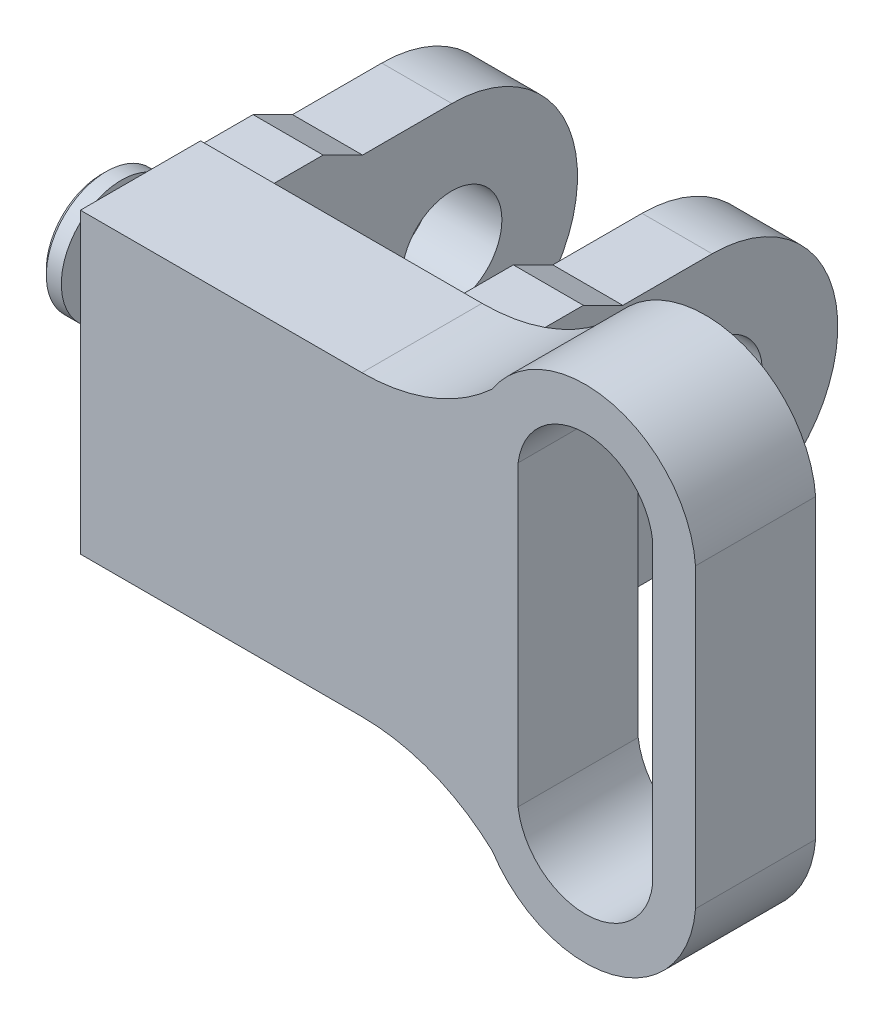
ISO-10303-21;
HEADER;
FILE_DESCRIPTION(('STEP AP214'),'2;1');
FILE_NAME('part.step','',(''),(''),'','','');
FILE_SCHEMA(('AUTOMOTIVE_DESIGN { 1 0 10303 214 1 1 1 1 }'));
ENDSEC;
DATA;
#1=APPLICATION_CONTEXT('core data for automotive mechanical design processes');
#2=APPLICATION_PROTOCOL_DEFINITION('international standard','automotive_design',2000,#1);
#3=PRODUCT_CONTEXT('',#1,'mechanical');
#4=PRODUCT('Part','Part','',(#3));
#5=PRODUCT_RELATED_PRODUCT_CATEGORY('part','',(#4));
#6=PRODUCT_DEFINITION_FORMATION('','',#4);
#7=PRODUCT_DEFINITION_CONTEXT('part definition',#1,'design');
#8=PRODUCT_DEFINITION('design','',#6,#7);
#9=PRODUCT_DEFINITION_SHAPE('','',#8);
#10=(LENGTH_UNIT() NAMED_UNIT(*) SI_UNIT(.MILLI.,.METRE.));
#11=(NAMED_UNIT(*) PLANE_ANGLE_UNIT() SI_UNIT($,.RADIAN.));
#12=(NAMED_UNIT(*) SI_UNIT($,.STERADIAN.) SOLID_ANGLE_UNIT());
#13=UNCERTAINTY_MEASURE_WITH_UNIT(LENGTH_MEASURE(1.E-05),#10,'distance_accuracy_value','');
#14=(GEOMETRIC_REPRESENTATION_CONTEXT(3) GLOBAL_UNCERTAINTY_ASSIGNED_CONTEXT((#13)) GLOBAL_UNIT_ASSIGNED_CONTEXT((#10,
#11,#12)) REPRESENTATION_CONTEXT('',''));
#15=CARTESIAN_POINT('',(0.,0.,0.));
#16=DIRECTION('',(0.,0.,1.));
#17=DIRECTION('',(1.,0.,0.));
#18=AXIS2_PLACEMENT_3D('',#15,#16,#17);
#19=CARTESIAN_POINT('',(237.915887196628,113.664011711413,-12.));
#20=DIRECTION('',(-1.,0.,0.));
#21=DIRECTION('',(0.,0.,-1.));
#22=AXIS2_PLACEMENT_3D('',#19,#20,#21);
#23=PLANE('',#22);
#24=DIRECTION('',(0.,-1.,0.));
#25=VECTOR('',#24,1.);
#26=CARTESIAN_POINT('',(237.915887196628,113.664011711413,-12.));
#27=LINE('',#26,#25);
#28=CARTESIAN_POINT('',(237.915887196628,143.421521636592,-12.));
#29=VERTEX_POINT('',#28);
#30=CARTESIAN_POINT('',(237.915887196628,113.664011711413,-12.));
#31=VERTEX_POINT('',#30);
#32=EDGE_CURVE('E383',#29,#31,#27,.T.);
#33=ORIENTED_EDGE('',*,*,#32,.F.);
#34=DIRECTION('',(0.,0.,-1.));
#35=VECTOR('',#34,1.);
#36=CARTESIAN_POINT('',(237.915887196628,143.421521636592,-12.));
#37=LINE('',#36,#35);
#38=CARTESIAN_POINT('',(237.915887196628,143.421521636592,-24.));
#39=VERTEX_POINT('',#38);
#40=EDGE_CURVE('E398',#29,#39,#37,.T.);
#41=ORIENTED_EDGE('',*,*,#40,.T.);
#42=DIRECTION('',(0.,-1.,0.));
#43=VECTOR('',#42,1.);
#44=CARTESIAN_POINT('',(237.915887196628,113.664011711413,-24.));
#45=LINE('',#44,#43);
#46=CARTESIAN_POINT('',(237.915887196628,143.068699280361,-24.));
#47=VERTEX_POINT('',#46);
#48=EDGE_CURVE('E366',#39,#47,#45,.T.);
#49=ORIENTED_EDGE('',*,*,#48,.T.);
#50=DIRECTION('',(0.,0.,1.));
#51=VECTOR('',#50,1.);
#52=CARTESIAN_POINT('',(237.915887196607,143.068699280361,-11.9999999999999));
#53=LINE('',#52,#51);
#54=CARTESIAN_POINT('',(237.915887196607,143.068699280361,-29.2445517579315));
#55=VERTEX_POINT('',#54);
#56=EDGE_CURVE('E288',#55,#47,#53,.T.);
#57=ORIENTED_EDGE('',*,*,#56,.F.);
#58=DIRECTION('',(0.,0.44721359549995,0.89442719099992));
#59=VECTOR('',#58,1.);
#60=CARTESIAN_POINT('',(237.915887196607,143.068699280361,-29.2445517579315));
#61=LINE('',#60,#59);
#62=CARTESIAN_POINT('',(237.915887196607,141.09831503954,-33.1853202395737));
#63=VERTEX_POINT('',#62);
#64=EDGE_CURVE('E274',#63,#55,#61,.T.);
#65=ORIENTED_EDGE('',*,*,#64,.F.);
#66=DIRECTION('',(0.,0.,1.));
#67=VECTOR('',#66,1.);
#68=CARTESIAN_POINT('',(237.915887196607,141.09831503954,-33.1853202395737));
#69=LINE('',#68,#67);
#70=CARTESIAN_POINT('',(237.915887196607,141.09831503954,-42.1039015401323));
#71=VERTEX_POINT('',#70);
#72=EDGE_CURVE('E303',#71,#63,#69,.T.);
#73=ORIENTED_EDGE('',*,*,#72,.F.);
#74=CARTESIAN_POINT('',(237.915887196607,128.542766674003,-42.1039015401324));
#75=DIRECTION('',(1.,0.,0.));
#76=DIRECTION('',(0.,0.,1.));
#77=AXIS2_PLACEMENT_3D('',#74,#75,#76);
#78=CIRCLE('',#77,12.5555483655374);
#79=CARTESIAN_POINT('',(237.915887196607,115.987218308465,-42.1039015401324));
#80=VERTEX_POINT('',#79);
#81=EDGE_CURVE('E300',#80,#71,#78,.T.);
#82=ORIENTED_EDGE('',*,*,#81,.F.);
#83=DIRECTION('',(0.,0.,-1.));
#84=VECTOR('',#83,1.);
#85=CARTESIAN_POINT('',(237.915887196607,115.987218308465,-33.1853202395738));
#86=LINE('',#85,#84);
#87=CARTESIAN_POINT('',(237.915887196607,115.987218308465,-33.1853202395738));
#88=VERTEX_POINT('',#87);
#89=EDGE_CURVE('E297',#88,#80,#86,.T.);
#90=ORIENTED_EDGE('',*,*,#89,.F.);
#91=DIRECTION('',(0.,0.447213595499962,-0.894427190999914));
#92=VECTOR('',#91,1.);
#93=CARTESIAN_POINT('',(237.915887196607,114.016834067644,-29.2445517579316));
#94=LINE('',#93,#92);
#95=CARTESIAN_POINT('',(237.915887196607,114.016834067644,-29.2445517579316));
#96=VERTEX_POINT('',#95);
#97=EDGE_CURVE('E294',#96,#88,#94,.T.);
#98=ORIENTED_EDGE('',*,*,#97,.F.);
#99=DIRECTION('',(0.,0.,-1.));
#100=VECTOR('',#99,1.);
#101=CARTESIAN_POINT('',(237.915887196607,114.016834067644,-12.));
#102=LINE('',#101,#100);
#103=CARTESIAN_POINT('',(237.915887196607,114.016834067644,-24.));
#104=VERTEX_POINT('',#103);
#105=EDGE_CURVE('E291',#104,#96,#102,.T.);
#106=ORIENTED_EDGE('',*,*,#105,.F.);
#107=CARTESIAN_POINT('',(237.915887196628,113.664011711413,-24.));
#108=VERTEX_POINT('',#107);
#109=EDGE_CURVE('E365',#104,#108,#45,.T.);
#110=ORIENTED_EDGE('',*,*,#109,.T.);
#111=DIRECTION('',(0.,0.,-1.));
#112=VECTOR('',#111,1.);
#113=CARTESIAN_POINT('',(237.915887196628,113.664011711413,-12.));
#114=LINE('',#113,#112);
#115=EDGE_CURVE('E418',#31,#108,#114,.T.);
#116=ORIENTED_EDGE('',*,*,#115,.F.);
#117=EDGE_LOOP('',(#33,#41,#49,#57,#65,#73,#82,#90,#98,#106,#110,#116));
#118=FACE_BOUND('',#117,.T.);
#119=CARTESIAN_POINT('',(237.915887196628,128.542766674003,-42.1039015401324));
#120=DIRECTION('',(1.,0.,0.));
#121=DIRECTION('',(0.,0.,-1.));
#122=AXIS2_PLACEMENT_3D('',#119,#120,#121);
#123=CIRCLE('',#122,5.);
#124=CARTESIAN_POINT('',(237.915887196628,128.542766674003,-47.1039015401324));
#125=VERTEX_POINT('',#124);
#126=EDGE_CURVE('E442',#125,#125,#123,.T.);
#127=ORIENTED_EDGE('',*,*,#126,.T.);
#128=EDGE_LOOP('',(#127));
#129=FACE_BOUND('',#128,.T.);
#130=CARTESIAN_POINT('',(237.915887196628,133.981521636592,-20.09));
#131=DIRECTION('',(1.,0.,0.));
#132=DIRECTION('',(0.,0.,-1.));
#133=AXIS2_PLACEMENT_3D('',#130,#131,#132);
#134=CIRCLE('',#133,6.);
#135=CARTESIAN_POINT('',(237.915887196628,133.981521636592,-26.09));
#136=VERTEX_POINT('',#135);
#137=EDGE_CURVE('E881',#136,#136,#134,.T.);
#138=ORIENTED_EDGE('',*,*,#137,.T.);
#139=EDGE_LOOP('',(#138));
#140=FACE_BOUND('',#139,.T.);
#141=ADVANCED_FACE('F36',(#118,#129,#140),#23,.T.);
#142=CARTESIAN_POINT('',(237.915887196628,143.421521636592,-12.));
#143=DIRECTION('',(0.,1.,0.));
#144=DIRECTION('',(0.,0.,-1.));
#145=AXIS2_PLACEMENT_3D('',#142,#143,#144);
#146=PLANE('',#145);
#147=DIRECTION('',(-1.,0.,0.));
#148=VECTOR('',#147,1.);
#149=CARTESIAN_POINT('',(237.915887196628,143.421521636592,-24.));
#150=LINE('',#149,#148);
#151=CARTESIAN_POINT('',(266.034275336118,143.421521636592,-24.));
#152=VERTEX_POINT('',#151);
#153=EDGE_CURVE('E363',#152,#39,#150,.T.);
#154=ORIENTED_EDGE('',*,*,#153,.T.);
#155=ORIENTED_EDGE('',*,*,#40,.F.);
#156=DIRECTION('',(-1.,0.,0.));
#157=VECTOR('',#156,1.);
#158=CARTESIAN_POINT('',(237.915887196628,143.421521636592,-12.));
#159=LINE('',#158,#157);
#160=CARTESIAN_POINT('',(266.034275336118,143.421521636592,-12.));
#161=VERTEX_POINT('',#160);
#162=EDGE_CURVE('E381',#161,#29,#159,.T.);
#163=ORIENTED_EDGE('',*,*,#162,.F.);
#164=DIRECTION('',(0.,0.,-1.));
#165=VECTOR('',#164,1.);
#166=CARTESIAN_POINT('',(266.034275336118,143.421521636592,-12.));
#167=LINE('',#166,#165);
#168=EDGE_CURVE('E399',#161,#152,#167,.T.);
#169=ORIENTED_EDGE('',*,*,#168,.T.);
#170=EDGE_LOOP('',(#154,#155,#163,#169));
#171=FACE_BOUND('',#170,.T.);
#172=ADVANCED_FACE('F38',(#171),#146,.T.);
#173=CARTESIAN_POINT('',(266.034275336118,162.613016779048,-12.));
#174=DIRECTION('',(0.,0.,-1.));
#175=DIRECTION('',(1.,0.,0.));
#176=AXIS2_PLACEMENT_3D('',#173,#174,#175);
#177=CYLINDRICAL_SURFACE('',#176,19.1914951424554);
#178=CARTESIAN_POINT('',(266.034275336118,162.613016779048,-24.));
#179=DIRECTION('',(0.,0.,-1.));
#180=DIRECTION('',(1.,0.,0.));
#181=AXIS2_PLACEMENT_3D('',#178,#179,#180);
#182=CIRCLE('',#181,19.1914951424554);
#183=CARTESIAN_POINT('',(279.064164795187,148.522755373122,-24.));
#184=VERTEX_POINT('',#183);
#185=EDGE_CURVE('E379',#184,#152,#182,.T.);
#186=ORIENTED_EDGE('',*,*,#185,.T.);
#187=ORIENTED_EDGE('',*,*,#168,.F.);
#188=CARTESIAN_POINT('',(266.034275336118,162.613016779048,-12.));
#189=DIRECTION('',(0.,0.,-1.));
#190=DIRECTION('',(1.,0.,0.));
#191=AXIS2_PLACEMENT_3D('',#188,#189,#190);
#192=CIRCLE('',#191,19.1914951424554);
#193=CARTESIAN_POINT('',(279.064164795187,148.522755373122,-12.));
#194=VERTEX_POINT('',#193);
#195=EDGE_CURVE('E396',#194,#161,#192,.T.);
#196=ORIENTED_EDGE('',*,*,#195,.F.);
#197=DIRECTION('',(0.,0.,-1.));
#198=VECTOR('',#197,1.);
#199=CARTESIAN_POINT('',(279.064164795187,148.522755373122,-12.));
#200=LINE('',#199,#198);
#201=EDGE_CURVE('E403',#194,#184,#200,.T.);
#202=ORIENTED_EDGE('',*,*,#201,.T.);
#203=EDGE_LOOP('',(#186,#187,#196,#202));
#204=FACE_BOUND('',#203,.T.);
#205=ADVANCED_FACE('F473',(#204),#177,.F.);
#206=CARTESIAN_POINT('',(288.343991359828,142.520870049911,-12.));
#207=DIRECTION('',(0.,0.,-1.));
#208=DIRECTION('',(1.,0.,0.));
#209=AXIS2_PLACEMENT_3D('',#206,#207,#208);
#210=CYLINDRICAL_SURFACE('',#209,11.0515975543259);
#211=CARTESIAN_POINT('',(288.343991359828,142.520870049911,-24.));
#212=DIRECTION('',(0.,0.,1.));
#213=DIRECTION('',(-1.,0.,0.));
#214=AXIS2_PLACEMENT_3D('',#211,#212,#213);
#215=CIRCLE('',#214,11.0515975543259);
#216=CARTESIAN_POINT('',(299.362616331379,143.373930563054,-24.));
#217=VERTEX_POINT('',#216);
#218=EDGE_CURVE('E377',#217,#184,#215,.T.);
#219=ORIENTED_EDGE('',*,*,#218,.T.);
#220=ORIENTED_EDGE('',*,*,#201,.F.);
#221=CARTESIAN_POINT('',(288.343991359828,142.520870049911,-12.));
#222=DIRECTION('',(0.,0.,1.));
#223=DIRECTION('',(-1.,0.,0.));
#224=AXIS2_PLACEMENT_3D('',#221,#222,#223);
#225=CIRCLE('',#224,11.0515975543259);
#226=CARTESIAN_POINT('',(299.362616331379,143.373930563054,-12.));
#227=VERTEX_POINT('',#226);
#228=EDGE_CURVE('E394',#227,#194,#225,.T.);
#229=ORIENTED_EDGE('',*,*,#228,.F.);
#230=DIRECTION('',(0.,0.,-1.));
#231=VECTOR('',#230,1.);
#232=CARTESIAN_POINT('',(299.362616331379,143.373930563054,-12.));
#233=LINE('',#232,#231);
#234=EDGE_CURVE('E406',#227,#217,#233,.T.);
#235=ORIENTED_EDGE('',*,*,#234,.T.);
#236=EDGE_LOOP('',(#219,#220,#229,#235));
#237=FACE_BOUND('',#236,.T.);
#238=ADVANCED_FACE('F494',(#237),#210,.T.);
#239=CARTESIAN_POINT('',(299.362616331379,143.373930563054,-12.));
#240=DIRECTION('',(1.,0.,0.));
#241=DIRECTION('',(0.,0.,1.));
#242=AXIS2_PLACEMENT_3D('',#239,#240,#241);
#243=PLANE('',#242);
#244=DIRECTION('',(0.,1.,0.));
#245=VECTOR('',#244,1.);
#246=CARTESIAN_POINT('',(299.362616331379,143.373930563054,-24.));
#247=LINE('',#246,#245);
#248=CARTESIAN_POINT('',(299.362616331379,113.711602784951,-24.));
#249=VERTEX_POINT('',#248);
#250=EDGE_CURVE('E375',#249,#217,#247,.T.);
#251=ORIENTED_EDGE('',*,*,#250,.T.);
#252=ORIENTED_EDGE('',*,*,#234,.F.);
#253=DIRECTION('',(0.,1.,0.));
#254=VECTOR('',#253,1.);
#255=CARTESIAN_POINT('',(299.362616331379,143.373930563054,-12.));
#256=LINE('',#255,#254);
#257=CARTESIAN_POINT('',(299.362616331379,113.711602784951,-12.));
#258=VERTEX_POINT('',#257);
#259=EDGE_CURVE('E392',#258,#227,#256,.T.);
#260=ORIENTED_EDGE('',*,*,#259,.F.);
#261=DIRECTION('',(0.,0.,-1.));
#262=VECTOR('',#261,1.);
#263=CARTESIAN_POINT('',(299.362616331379,113.711602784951,-12.));
#264=LINE('',#263,#262);
#265=EDGE_CURVE('E409',#258,#249,#264,.T.);
#266=ORIENTED_EDGE('',*,*,#265,.T.);
#267=EDGE_LOOP('',(#251,#252,#260,#266));
#268=FACE_BOUND('',#267,.T.);
#269=ADVANCED_FACE('F490',(#268),#243,.T.);
#270=CARTESIAN_POINT('',(288.343991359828,114.564663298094,-12.));
#271=DIRECTION('',(0.,0.,-1.));
#272=DIRECTION('',(1.,0.,0.));
#273=AXIS2_PLACEMENT_3D('',#270,#271,#272);
#274=CYLINDRICAL_SURFACE('',#273,11.0515975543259);
#275=CARTESIAN_POINT('',(288.343991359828,114.564663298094,-24.));
#276=DIRECTION('',(0.,0.,1.));
#277=DIRECTION('',(1.,0.,0.));
#278=AXIS2_PLACEMENT_3D('',#275,#276,#277);
#279=CIRCLE('',#278,11.0515975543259);
#280=CARTESIAN_POINT('',(279.064164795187,108.562777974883,-24.));
#281=VERTEX_POINT('',#280);
#282=EDGE_CURVE('E373',#281,#249,#279,.T.);
#283=ORIENTED_EDGE('',*,*,#282,.T.);
#284=ORIENTED_EDGE('',*,*,#265,.F.);
#285=CARTESIAN_POINT('',(288.343991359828,114.564663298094,-12.));
#286=DIRECTION('',(0.,0.,1.));
#287=DIRECTION('',(1.,0.,0.));
#288=AXIS2_PLACEMENT_3D('',#285,#286,#287);
#289=CIRCLE('',#288,11.0515975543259);
#290=CARTESIAN_POINT('',(279.064164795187,108.562777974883,-12.));
#291=VERTEX_POINT('',#290);
#292=EDGE_CURVE('E390',#291,#258,#289,.T.);
#293=ORIENTED_EDGE('',*,*,#292,.F.);
#294=DIRECTION('',(0.,0.,-1.));
#295=VECTOR('',#294,1.);
#296=CARTESIAN_POINT('',(279.064164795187,108.562777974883,-12.));
#297=LINE('',#296,#295);
#298=EDGE_CURVE('E412',#291,#281,#297,.T.);
#299=ORIENTED_EDGE('',*,*,#298,.T.);
#300=EDGE_LOOP('',(#283,#284,#293,#299));
#301=FACE_BOUND('',#300,.T.);
#302=ADVANCED_FACE('F486',(#301),#274,.T.);
#303=CARTESIAN_POINT('',(266.034275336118,94.4725165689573,-12.));
#304=DIRECTION('',(0.,0.,-1.));
#305=DIRECTION('',(1.,0.,0.));
#306=AXIS2_PLACEMENT_3D('',#303,#304,#305);
#307=CYLINDRICAL_SURFACE('',#306,19.1914951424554);
#308=CARTESIAN_POINT('',(266.034275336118,94.4725165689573,-24.));
#309=DIRECTION('',(0.,0.,-1.));
#310=DIRECTION('',(-1.,0.,0.));
#311=AXIS2_PLACEMENT_3D('',#308,#309,#310);
#312=CIRCLE('',#311,19.1914951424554);
#313=CARTESIAN_POINT('',(266.034275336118,113.664011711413,-24.));
#314=VERTEX_POINT('',#313);
#315=EDGE_CURVE('E371',#314,#281,#312,.T.);
#316=ORIENTED_EDGE('',*,*,#315,.T.);
#317=ORIENTED_EDGE('',*,*,#298,.F.);
#318=CARTESIAN_POINT('',(266.034275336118,94.4725165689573,-12.));
#319=DIRECTION('',(0.,0.,-1.));
#320=DIRECTION('',(-1.,0.,0.));
#321=AXIS2_PLACEMENT_3D('',#318,#319,#320);
#322=CIRCLE('',#321,19.1914951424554);
#323=CARTESIAN_POINT('',(266.034275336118,113.664011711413,-12.));
#324=VERTEX_POINT('',#323);
#325=EDGE_CURVE('E388',#324,#291,#322,.T.);
#326=ORIENTED_EDGE('',*,*,#325,.F.);
#327=DIRECTION('',(0.,0.,-1.));
#328=VECTOR('',#327,1.);
#329=CARTESIAN_POINT('',(266.034275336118,113.664011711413,-12.));
#330=LINE('',#329,#328);
#331=EDGE_CURVE('E415',#324,#314,#330,.T.);
#332=ORIENTED_EDGE('',*,*,#331,.T.);
#333=EDGE_LOOP('',(#316,#317,#326,#332));
#334=FACE_BOUND('',#333,.T.);
#335=ADVANCED_FACE('F482',(#334),#307,.F.);
#336=CARTESIAN_POINT('',(237.915887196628,113.664011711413,-12.));
#337=DIRECTION('',(0.,-1.,0.));
#338=DIRECTION('',(0.,0.,1.));
#339=AXIS2_PLACEMENT_3D('',#336,#337,#338);
#340=PLANE('',#339);
#341=DIRECTION('',(1.,0.,0.));
#342=VECTOR('',#341,1.);
#343=CARTESIAN_POINT('',(237.915887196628,113.664011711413,-24.));
#344=LINE('',#343,#342);
#345=EDGE_CURVE('E369',#108,#314,#344,.T.);
#346=ORIENTED_EDGE('',*,*,#345,.T.);
#347=ORIENTED_EDGE('',*,*,#331,.F.);
#348=DIRECTION('',(1.,0.,0.));
#349=VECTOR('',#348,1.);
#350=CARTESIAN_POINT('',(237.915887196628,113.664011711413,-12.));
#351=LINE('',#350,#349);
#352=EDGE_CURVE('E386',#31,#324,#351,.T.);
#353=ORIENTED_EDGE('',*,*,#352,.F.);
#354=ORIENTED_EDGE('',*,*,#115,.T.);
#355=EDGE_LOOP('',(#346,#347,#353,#354));
#356=FACE_BOUND('',#355,.T.);
#357=ADVANCED_FACE('F478',(#356),#340,.T.);
#358=CARTESIAN_POINT('',(266.034275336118,162.613016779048,-12.));
#359=DIRECTION('',(0.,0.,-1.));
#360=DIRECTION('',(1.,0.,0.));
#361=AXIS2_PLACEMENT_3D('',#358,#359,#360);
#362=PLANE('',#361);
#363=ORIENTED_EDGE('',*,*,#352,.T.);
#364=ORIENTED_EDGE('',*,*,#325,.T.);
#365=ORIENTED_EDGE('',*,*,#292,.T.);
#366=ORIENTED_EDGE('',*,*,#259,.T.);
#367=ORIENTED_EDGE('',*,*,#228,.T.);
#368=ORIENTED_EDGE('',*,*,#195,.T.);
#369=ORIENTED_EDGE('',*,*,#162,.T.);
#370=ORIENTED_EDGE('',*,*,#32,.T.);
#371=EDGE_LOOP('',(#363,#364,#365,#366,#367,#368,#369,#370));
#372=FACE_BOUND('',#371,.T.);
#373=DIRECTION('',(0.,1.,0.));
#374=VECTOR('',#373,1.);
#375=CARTESIAN_POINT('',(295.08459489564,162.613016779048,-12.));
#376=LINE('',#375,#374);
#377=CARTESIAN_POINT('',(295.08459489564,113.711602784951,-12.));
#378=VERTEX_POINT('',#377);
#379=CARTESIAN_POINT('',(295.08459489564,143.373930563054,-12.));
#380=VERTEX_POINT('',#379);
#381=EDGE_CURVE('E357',#378,#380,#376,.T.);
#382=ORIENTED_EDGE('',*,*,#381,.F.);
#383=CARTESIAN_POINT('',(288.357820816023,114.510142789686,-12.));
#384=DIRECTION('',(0.,0.,1.));
#385=DIRECTION('',(1.,0.,0.));
#386=AXIS2_PLACEMENT_3D('',#383,#384,#385);
#387=CIRCLE('',#386,6.77400587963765);
#388=CARTESIAN_POINT('',(281.636867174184,113.664011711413,-12.));
#389=VERTEX_POINT('',#388);
#390=EDGE_CURVE('E354',#389,#378,#387,.T.);
#391=ORIENTED_EDGE('',*,*,#390,.F.);
#392=DIRECTION('',(0.,-1.,0.));
#393=VECTOR('',#392,1.);
#394=CARTESIAN_POINT('',(281.636867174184,162.613016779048,-12.));
#395=LINE('',#394,#393);
#396=CARTESIAN_POINT('',(281.636867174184,143.421521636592,-12.));
#397=VERTEX_POINT('',#396);
#398=EDGE_CURVE('E346',#397,#389,#395,.T.);
#399=ORIENTED_EDGE('',*,*,#398,.F.);
#400=CARTESIAN_POINT('',(288.357820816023,142.575390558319,-12.));
#401=DIRECTION('',(0.,0.,1.));
#402=DIRECTION('',(1.,0.,0.));
#403=AXIS2_PLACEMENT_3D('',#400,#401,#402);
#404=CIRCLE('',#403,6.77400587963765);
#405=EDGE_CURVE('E360',#380,#397,#404,.T.);
#406=ORIENTED_EDGE('',*,*,#405,.F.);
#407=EDGE_LOOP('',(#382,#391,#399,#406));
#408=FACE_BOUND('',#407,.T.);
#409=ADVANCED_FACE('F481',(#372,#408),#362,.F.);
#410=CARTESIAN_POINT('',(266.034275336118,162.613016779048,-24.));
#411=DIRECTION('',(0.,0.,-1.));
#412=DIRECTION('',(1.,0.,0.));
#413=AXIS2_PLACEMENT_3D('',#410,#411,#412);
#414=PLANE('',#413);
#415=DIRECTION('',(0.,1.,0.));
#416=VECTOR('',#415,1.);
#417=CARTESIAN_POINT('',(270.915887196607,162.613016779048,-24.));
#418=LINE('',#417,#416);
#419=CARTESIAN_POINT('',(270.915887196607,114.016834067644,-24.));
#420=VERTEX_POINT('',#419);
#421=CARTESIAN_POINT('',(270.915887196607,143.068699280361,-24.));
#422=VERTEX_POINT('',#421);
#423=EDGE_CURVE('E436',#420,#422,#418,.T.);
#424=ORIENTED_EDGE('',*,*,#423,.T.);
#425=DIRECTION('',(-1.,0.,0.));
#426=VECTOR('',#425,1.);
#427=CARTESIAN_POINT('',(266.034275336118,143.068699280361,-24.));
#428=LINE('',#427,#426);
#429=CARTESIAN_POINT('',(263.915887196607,143.068699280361,-24.));
#430=VERTEX_POINT('',#429);
#431=EDGE_CURVE('E431',#422,#430,#428,.T.);
#432=ORIENTED_EDGE('',*,*,#431,.T.);
#433=DIRECTION('',(0.,1.,0.));
#434=VECTOR('',#433,1.);
#435=CARTESIAN_POINT('',(263.915887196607,162.613016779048,-24.));
#436=LINE('',#435,#434);
#437=CARTESIAN_POINT('',(263.915887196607,114.016834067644,-24.));
#438=VERTEX_POINT('',#437);
#439=EDGE_CURVE('E227',#438,#430,#436,.T.);
#440=ORIENTED_EDGE('',*,*,#439,.F.);
#441=DIRECTION('',(1.,0.,0.));
#442=VECTOR('',#441,1.);
#443=CARTESIAN_POINT('',(266.034275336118,114.016834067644,-24.));
#444=LINE('',#443,#442);
#445=EDGE_CURVE('E433',#438,#420,#444,.T.);
#446=ORIENTED_EDGE('',*,*,#445,.T.);
#447=EDGE_LOOP('',(#424,#432,#440,#446));
#448=FACE_BOUND('',#447,.T.);
#449=DIRECTION('',(1.,0.,0.));
#450=VECTOR('',#449,1.);
#451=CARTESIAN_POINT('',(266.034275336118,114.016834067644,-24.));
#452=LINE('',#451,#450);
#453=CARTESIAN_POINT('',(244.915887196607,114.016834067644,-24.));
#454=VERTEX_POINT('',#453);
#455=EDGE_CURVE('E427',#104,#454,#452,.T.);
#456=ORIENTED_EDGE('',*,*,#455,.T.);
#457=DIRECTION('',(0.,1.,0.));
#458=VECTOR('',#457,1.);
#459=CARTESIAN_POINT('',(244.915887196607,162.613016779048,-24.));
#460=LINE('',#459,#458);
#461=CARTESIAN_POINT('',(244.915887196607,143.068699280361,-24.));
#462=VERTEX_POINT('',#461);
#463=EDGE_CURVE('E402',#454,#462,#460,.T.);
#464=ORIENTED_EDGE('',*,*,#463,.T.);
#465=DIRECTION('',(-1.,0.,0.));
#466=VECTOR('',#465,1.);
#467=CARTESIAN_POINT('',(266.034275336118,143.068699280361,-24.));
#468=LINE('',#467,#466);
#469=EDGE_CURVE('E425',#462,#47,#468,.T.);
#470=ORIENTED_EDGE('',*,*,#469,.T.);
#471=ORIENTED_EDGE('',*,*,#48,.F.);
#472=ORIENTED_EDGE('',*,*,#153,.F.);
#473=ORIENTED_EDGE('',*,*,#185,.F.);
#474=ORIENTED_EDGE('',*,*,#218,.F.);
#475=ORIENTED_EDGE('',*,*,#250,.F.);
#476=ORIENTED_EDGE('',*,*,#282,.F.);
#477=ORIENTED_EDGE('',*,*,#315,.F.);
#478=ORIENTED_EDGE('',*,*,#345,.F.);
#479=ORIENTED_EDGE('',*,*,#109,.F.);
#480=EDGE_LOOP('',(#456,#464,#470,#471,#472,#473,#474,#475,#476,#477,#478,#479));
#481=FACE_BOUND('',#480,.T.);
#482=CARTESIAN_POINT('',(288.357820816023,142.575390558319,-24.));
#483=DIRECTION('',(0.,0.,1.));
#484=DIRECTION('',(1.,0.,0.));
#485=AXIS2_PLACEMENT_3D('',#482,#483,#484);
#486=CIRCLE('',#485,6.77400587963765);
#487=CARTESIAN_POINT('',(295.08459489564,143.373930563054,-24.));
#488=VERTEX_POINT('',#487);
#489=CARTESIAN_POINT('',(281.636867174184,143.421521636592,-24.));
#490=VERTEX_POINT('',#489);
#491=EDGE_CURVE('E322',#488,#490,#486,.T.);
#492=ORIENTED_EDGE('',*,*,#491,.T.);
#493=DIRECTION('',(0.,-1.,0.));
#494=VECTOR('',#493,1.);
#495=CARTESIAN_POINT('',(281.636867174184,143.421521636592,-24.));
#496=LINE('',#495,#494);
#497=CARTESIAN_POINT('',(281.636867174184,113.664011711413,-24.));
#498=VERTEX_POINT('',#497);
#499=EDGE_CURVE('E334',#490,#498,#496,.T.);
#500=ORIENTED_EDGE('',*,*,#499,.T.);
#501=CARTESIAN_POINT('',(288.357820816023,114.510142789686,-24.));
#502=DIRECTION('',(0.,0.,1.));
#503=DIRECTION('',(-1.,0.,0.));
#504=AXIS2_PLACEMENT_3D('',#501,#502,#503);
#505=CIRCLE('',#504,6.77400587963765);
#506=CARTESIAN_POINT('',(295.08459489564,113.711602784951,-24.));
#507=VERTEX_POINT('',#506);
#508=EDGE_CURVE('E337',#498,#507,#505,.T.);
#509=ORIENTED_EDGE('',*,*,#508,.T.);
#510=DIRECTION('',(0.,1.,0.));
#511=VECTOR('',#510,1.);
#512=CARTESIAN_POINT('',(295.08459489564,143.373930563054,-24.));
#513=LINE('',#512,#511);
#514=EDGE_CURVE('E340',#507,#488,#513,.T.);
#515=ORIENTED_EDGE('',*,*,#514,.T.);
#516=EDGE_LOOP('',(#492,#500,#509,#515));
#517=FACE_BOUND('',#516,.T.);
#518=ADVANCED_FACE('F504',(#448,#481,#517),#414,.T.);
#519=CARTESIAN_POINT('',(288.357820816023,142.575390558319,-4.));
#520=DIRECTION('',(0.,0.,-1.));
#521=DIRECTION('',(1.,0.,0.));
#522=AXIS2_PLACEMENT_3D('',#519,#520,#521);
#523=CYLINDRICAL_SURFACE('',#522,6.77400587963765);
#524=DIRECTION('',(0.,0.,-1.));
#525=VECTOR('',#524,1.);
#526=CARTESIAN_POINT('',(295.08459489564,143.373930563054,-4.));
#527=LINE('',#526,#525);
#528=EDGE_CURVE('E344',#380,#488,#527,.T.);
#529=ORIENTED_EDGE('',*,*,#528,.F.);
#530=ORIENTED_EDGE('',*,*,#405,.T.);
#531=DIRECTION('',(0.,0.,-1.));
#532=VECTOR('',#531,1.);
#533=CARTESIAN_POINT('',(281.636867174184,143.421521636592,-4.));
#534=LINE('',#533,#532);
#535=EDGE_CURVE('E343',#397,#490,#534,.T.);
#536=ORIENTED_EDGE('',*,*,#535,.T.);
#537=ORIENTED_EDGE('',*,*,#491,.F.);
#538=EDGE_LOOP('',(#529,#530,#536,#537));
#539=FACE_BOUND('',#538,.T.);
#540=ADVANCED_FACE('F508',(#539),#523,.F.);
#541=CARTESIAN_POINT('',(295.08459489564,143.373930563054,-4.));
#542=DIRECTION('',(1.,0.,0.));
#543=DIRECTION('',(0.,0.,1.));
#544=AXIS2_PLACEMENT_3D('',#541,#542,#543);
#545=PLANE('',#544);
#546=DIRECTION('',(0.,0.,-1.));
#547=VECTOR('',#546,1.);
#548=CARTESIAN_POINT('',(295.08459489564,113.711602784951,-4.));
#549=LINE('',#548,#547);
#550=EDGE_CURVE('E347',#378,#507,#549,.T.);
#551=ORIENTED_EDGE('',*,*,#550,.F.);
#552=ORIENTED_EDGE('',*,*,#381,.T.);
#553=ORIENTED_EDGE('',*,*,#528,.T.);
#554=ORIENTED_EDGE('',*,*,#514,.F.);
#555=EDGE_LOOP('',(#551,#552,#553,#554));
#556=FACE_BOUND('',#555,.T.);
#557=ADVANCED_FACE('F512',(#556),#545,.F.);
#558=CARTESIAN_POINT('',(288.357820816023,114.510142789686,-4.));
#559=DIRECTION('',(0.,0.,-1.));
#560=DIRECTION('',(1.,0.,0.));
#561=AXIS2_PLACEMENT_3D('',#558,#559,#560);
#562=CYLINDRICAL_SURFACE('',#561,6.77400587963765);
#563=DIRECTION('',(0.,0.,-1.));
#564=VECTOR('',#563,1.);
#565=CARTESIAN_POINT('',(281.636867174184,113.664011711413,-4.));
#566=LINE('',#565,#564);
#567=EDGE_CURVE('E349',#389,#498,#566,.T.);
#568=ORIENTED_EDGE('',*,*,#567,.F.);
#569=ORIENTED_EDGE('',*,*,#390,.T.);
#570=ORIENTED_EDGE('',*,*,#550,.T.);
#571=ORIENTED_EDGE('',*,*,#508,.F.);
#572=EDGE_LOOP('',(#568,#569,#570,#571));
#573=FACE_BOUND('',#572,.T.);
#574=ADVANCED_FACE('F518',(#573),#562,.F.);
#575=CARTESIAN_POINT('',(281.636867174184,143.421521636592,-4.));
#576=DIRECTION('',(-1.,0.,0.));
#577=DIRECTION('',(0.,0.,-1.));
#578=AXIS2_PLACEMENT_3D('',#575,#576,#577);
#579=PLANE('',#578);
#580=ORIENTED_EDGE('',*,*,#535,.F.);
#581=ORIENTED_EDGE('',*,*,#398,.T.);
#582=ORIENTED_EDGE('',*,*,#567,.T.);
#583=ORIENTED_EDGE('',*,*,#499,.F.);
#584=EDGE_LOOP('',(#580,#581,#582,#583));
#585=FACE_BOUND('',#584,.T.);
#586=ADVANCED_FACE('F514',(#585),#579,.F.);
#587=CARTESIAN_POINT('',(244.915887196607,143.068699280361,-29.2445517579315));
#588=DIRECTION('',(0.,0.89442719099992,-0.44721359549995));
#589=DIRECTION('',(0.,-0.44721359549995,-0.89442719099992));
#590=AXIS2_PLACEMENT_3D('',#587,#588,#589);
#591=PLANE('',#590);
#592=ORIENTED_EDGE('',*,*,#64,.T.);
#593=DIRECTION('',(-1.,0.,0.));
#594=VECTOR('',#593,1.);
#595=CARTESIAN_POINT('',(244.915887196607,143.068699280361,-29.2445517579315));
#596=LINE('',#595,#594);
#597=CARTESIAN_POINT('',(244.915887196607,143.068699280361,-29.2445517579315));
#598=VERTEX_POINT('',#597);
#599=EDGE_CURVE('E319',#598,#55,#596,.T.);
#600=ORIENTED_EDGE('',*,*,#599,.F.);
#601=DIRECTION('',(0.,0.44721359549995,0.89442719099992));
#602=VECTOR('',#601,1.);
#603=CARTESIAN_POINT('',(244.915887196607,143.068699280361,-29.2445517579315));
#604=LINE('',#603,#602);
#605=CARTESIAN_POINT('',(244.915887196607,141.09831503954,-33.1853202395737));
#606=VERTEX_POINT('',#605);
#607=EDGE_CURVE('E306',#606,#598,#604,.T.);
#608=ORIENTED_EDGE('',*,*,#607,.F.);
#609=DIRECTION('',(-1.,0.,0.));
#610=VECTOR('',#609,1.);
#611=CARTESIAN_POINT('',(244.915887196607,141.09831503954,-33.1853202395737));
#612=LINE('',#611,#610);
#613=EDGE_CURVE('E320',#606,#63,#612,.T.);
#614=ORIENTED_EDGE('',*,*,#613,.T.);
#615=EDGE_LOOP('',(#592,#600,#608,#614));
#616=FACE_BOUND('',#615,.T.);
#617=ADVANCED_FACE('F517',(#616),#591,.T.);
#618=CARTESIAN_POINT('',(244.915887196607,141.09831503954,-33.1853202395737));
#619=DIRECTION('',(0.,1.,0.));
#620=DIRECTION('',(0.,0.,-1.));
#621=AXIS2_PLACEMENT_3D('',#618,#619,#620);
#622=PLANE('',#621);
#623=ORIENTED_EDGE('',*,*,#72,.T.);
#624=ORIENTED_EDGE('',*,*,#613,.F.);
#625=DIRECTION('',(0.,0.,1.));
#626=VECTOR('',#625,1.);
#627=CARTESIAN_POINT('',(244.915887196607,141.09831503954,-33.1853202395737));
#628=LINE('',#627,#626);
#629=CARTESIAN_POINT('',(244.915887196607,141.09831503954,-42.1039015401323));
#630=VERTEX_POINT('',#629);
#631=EDGE_CURVE('E317',#630,#606,#628,.T.);
#632=ORIENTED_EDGE('',*,*,#631,.F.);
#633=DIRECTION('',(-1.,0.,0.));
#634=VECTOR('',#633,1.);
#635=CARTESIAN_POINT('',(244.915887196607,141.09831503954,-42.1039015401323));
#636=LINE('',#635,#634);
#637=EDGE_CURVE('E323',#630,#71,#636,.T.);
#638=ORIENTED_EDGE('',*,*,#637,.T.);
#639=EDGE_LOOP('',(#623,#624,#632,#638));
#640=FACE_BOUND('',#639,.T.);
#641=ADVANCED_FACE('F528',(#640),#622,.T.);
#642=CARTESIAN_POINT('',(244.915887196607,128.542766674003,-42.1039015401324));
#643=DIRECTION('',(-1.,0.,0.));
#644=DIRECTION('',(0.,0.,-1.));
#645=AXIS2_PLACEMENT_3D('',#642,#643,#644);
#646=CYLINDRICAL_SURFACE('',#645,12.5555483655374);
#647=ORIENTED_EDGE('',*,*,#81,.T.);
#648=ORIENTED_EDGE('',*,*,#637,.F.);
#649=CARTESIAN_POINT('',(244.915887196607,128.542766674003,-42.1039015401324));
#650=DIRECTION('',(1.,0.,0.));
#651=DIRECTION('',(0.,0.,1.));
#652=AXIS2_PLACEMENT_3D('',#649,#650,#651);
#653=CIRCLE('',#652,12.5555483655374);
#654=CARTESIAN_POINT('',(244.915887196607,115.987218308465,-42.1039015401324));
#655=VERTEX_POINT('',#654);
#656=EDGE_CURVE('E315',#655,#630,#653,.T.);
#657=ORIENTED_EDGE('',*,*,#656,.F.);
#658=DIRECTION('',(-1.,0.,0.));
#659=VECTOR('',#658,1.);
#660=CARTESIAN_POINT('',(244.915887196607,115.987218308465,-42.1039015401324));
#661=LINE('',#660,#659);
#662=EDGE_CURVE('E325',#655,#80,#661,.T.);
#663=ORIENTED_EDGE('',*,*,#662,.T.);
#664=EDGE_LOOP('',(#647,#648,#657,#663));
#665=FACE_BOUND('',#664,.T.);
#666=ADVANCED_FACE('F546',(#665),#646,.T.);
#667=CARTESIAN_POINT('',(244.915887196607,115.987218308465,-33.1853202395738));
#668=DIRECTION('',(0.,-1.,0.));
#669=DIRECTION('',(0.,0.,1.));
#670=AXIS2_PLACEMENT_3D('',#667,#668,#669);
#671=PLANE('',#670);
#672=ORIENTED_EDGE('',*,*,#89,.T.);
#673=ORIENTED_EDGE('',*,*,#662,.F.);
#674=DIRECTION('',(0.,0.,-1.));
#675=VECTOR('',#674,1.);
#676=CARTESIAN_POINT('',(244.915887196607,115.987218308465,-33.1853202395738));
#677=LINE('',#676,#675);
#678=CARTESIAN_POINT('',(244.915887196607,115.987218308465,-33.1853202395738));
#679=VERTEX_POINT('',#678);
#680=EDGE_CURVE('E313',#679,#655,#677,.T.);
#681=ORIENTED_EDGE('',*,*,#680,.F.);
#682=DIRECTION('',(-1.,0.,0.));
#683=VECTOR('',#682,1.);
#684=CARTESIAN_POINT('',(244.915887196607,115.987218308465,-33.1853202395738));
#685=LINE('',#684,#683);
#686=EDGE_CURVE('E327',#679,#88,#685,.T.);
#687=ORIENTED_EDGE('',*,*,#686,.T.);
#688=EDGE_LOOP('',(#672,#673,#681,#687));
#689=FACE_BOUND('',#688,.T.);
#690=ADVANCED_FACE('F542',(#689),#671,.T.);
#691=CARTESIAN_POINT('',(244.915887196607,114.016834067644,-29.2445517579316));
#692=DIRECTION('',(0.,-0.894427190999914,-0.447213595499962));
#693=DIRECTION('',(0.,-0.447213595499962,0.894427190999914));
#694=AXIS2_PLACEMENT_3D('',#691,#692,#693);
#695=PLANE('',#694);
#696=ORIENTED_EDGE('',*,*,#97,.T.);
#697=ORIENTED_EDGE('',*,*,#686,.F.);
#698=DIRECTION('',(0.,0.447213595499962,-0.894427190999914));
#699=VECTOR('',#698,1.);
#700=CARTESIAN_POINT('',(244.915887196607,114.016834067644,-29.2445517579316));
#701=LINE('',#700,#699);
#702=CARTESIAN_POINT('',(244.915887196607,114.016834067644,-29.2445517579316));
#703=VERTEX_POINT('',#702);
#704=EDGE_CURVE('E311',#703,#679,#701,.T.);
#705=ORIENTED_EDGE('',*,*,#704,.F.);
#706=DIRECTION('',(-1.,0.,0.));
#707=VECTOR('',#706,1.);
#708=CARTESIAN_POINT('',(244.915887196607,114.016834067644,-29.2445517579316));
#709=LINE('',#708,#707);
#710=EDGE_CURVE('E329',#703,#96,#709,.T.);
#711=ORIENTED_EDGE('',*,*,#710,.T.);
#712=EDGE_LOOP('',(#696,#697,#705,#711));
#713=FACE_BOUND('',#712,.T.);
#714=ADVANCED_FACE('F538',(#713),#695,.T.);
#715=CARTESIAN_POINT('',(244.915887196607,114.016834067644,-12.));
#716=DIRECTION('',(0.,-1.,0.));
#717=DIRECTION('',(0.,0.,1.));
#718=AXIS2_PLACEMENT_3D('',#715,#716,#717);
#719=PLANE('',#718);
#720=ORIENTED_EDGE('',*,*,#105,.T.);
#721=ORIENTED_EDGE('',*,*,#710,.F.);
#722=DIRECTION('',(0.,0.,-1.));
#723=VECTOR('',#722,1.);
#724=CARTESIAN_POINT('',(244.915887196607,114.016834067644,-12.));
#725=LINE('',#724,#723);
#726=EDGE_CURVE('E309',#454,#703,#725,.T.);
#727=ORIENTED_EDGE('',*,*,#726,.F.);
#728=ORIENTED_EDGE('',*,*,#455,.F.);
#729=EDGE_LOOP('',(#720,#721,#727,#728));
#730=FACE_BOUND('',#729,.T.);
#731=ADVANCED_FACE('F534',(#730),#719,.T.);
#732=CARTESIAN_POINT('',(244.915887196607,143.068699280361,-11.9999999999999));
#733=DIRECTION('',(0.,1.,0.));
#734=DIRECTION('',(0.,0.,-1.));
#735=AXIS2_PLACEMENT_3D('',#732,#733,#734);
#736=PLANE('',#735);
#737=DIRECTION('',(0.,0.,1.));
#738=VECTOR('',#737,1.);
#739=CARTESIAN_POINT('',(244.915887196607,143.068699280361,-11.9999999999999));
#740=LINE('',#739,#738);
#741=EDGE_CURVE('E59',#598,#462,#740,.T.);
#742=ORIENTED_EDGE('',*,*,#741,.F.);
#743=ORIENTED_EDGE('',*,*,#599,.T.);
#744=ORIENTED_EDGE('',*,*,#56,.T.);
#745=ORIENTED_EDGE('',*,*,#469,.F.);
#746=EDGE_LOOP('',(#742,#743,#744,#745));
#747=FACE_BOUND('',#746,.T.);
#748=ADVANCED_FACE('F530',(#747),#736,.T.);
#749=CARTESIAN_POINT('',(244.915887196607,128.542766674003,-42.1039015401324));
#750=DIRECTION('',(1.,0.,0.));
#751=DIRECTION('',(0.,0.,1.));
#752=AXIS2_PLACEMENT_3D('',#749,#750,#751);
#753=PLANE('',#752);
#754=CARTESIAN_POINT('',(244.915887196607,128.542766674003,-42.1039015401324));
#755=DIRECTION('',(-1.,0.,0.));
#756=DIRECTION('',(0.,0.,1.));
#757=AXIS2_PLACEMENT_3D('',#754,#755,#756);
#758=CIRCLE('',#757,5.);
#759=CARTESIAN_POINT('',(244.915887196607,128.542766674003,-37.1039015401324));
#760=VERTEX_POINT('',#759);
#761=EDGE_CURVE('E245',#760,#760,#758,.T.);
#762=ORIENTED_EDGE('',*,*,#761,.T.);
#763=EDGE_LOOP('',(#762));
#764=FACE_BOUND('',#763,.T.);
#765=ORIENTED_EDGE('',*,*,#726,.T.);
#766=ORIENTED_EDGE('',*,*,#704,.T.);
#767=ORIENTED_EDGE('',*,*,#680,.T.);
#768=ORIENTED_EDGE('',*,*,#656,.T.);
#769=ORIENTED_EDGE('',*,*,#631,.T.);
#770=ORIENTED_EDGE('',*,*,#607,.T.);
#771=ORIENTED_EDGE('',*,*,#741,.T.);
#772=ORIENTED_EDGE('',*,*,#463,.F.);
#773=EDGE_LOOP('',(#765,#766,#767,#768,#769,#770,#771,#772));
#774=FACE_BOUND('',#773,.T.);
#775=ADVANCED_FACE('F533',(#764,#774),#753,.T.);
#776=CARTESIAN_POINT('',(270.915887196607,143.068699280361,-29.2445517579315));
#777=DIRECTION('',(0.,0.89442719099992,-0.44721359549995));
#778=DIRECTION('',(0.,-0.44721359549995,-0.89442719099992));
#779=AXIS2_PLACEMENT_3D('',#776,#777,#778);
#780=PLANE('',#779);
#781=DIRECTION('',(0.,0.44721359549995,0.89442719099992));
#782=VECTOR('',#781,1.);
#783=CARTESIAN_POINT('',(263.915887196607,143.068699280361,-29.2445517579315));
#784=LINE('',#783,#782);
#785=CARTESIAN_POINT('',(263.915887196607,141.09831503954,-33.1853202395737));
#786=VERTEX_POINT('',#785);
#787=CARTESIAN_POINT('',(263.915887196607,143.068699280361,-29.2445517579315));
#788=VERTEX_POINT('',#787);
#789=EDGE_CURVE('E225',#786,#788,#784,.T.);
#790=ORIENTED_EDGE('',*,*,#789,.T.);
#791=DIRECTION('',(-1.,0.,0.));
#792=VECTOR('',#791,1.);
#793=CARTESIAN_POINT('',(270.915887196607,143.068699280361,-29.2445517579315));
#794=LINE('',#793,#792);
#795=CARTESIAN_POINT('',(270.915887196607,143.068699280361,-29.2445517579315));
#796=VERTEX_POINT('',#795);
#797=EDGE_CURVE('E232',#796,#788,#794,.T.);
#798=ORIENTED_EDGE('',*,*,#797,.F.);
#799=DIRECTION('',(0.,0.44721359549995,0.89442719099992));
#800=VECTOR('',#799,1.);
#801=CARTESIAN_POINT('',(270.915887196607,143.068699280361,-29.2445517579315));
#802=LINE('',#801,#800);
#803=CARTESIAN_POINT('',(270.915887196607,141.09831503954,-33.1853202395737));
#804=VERTEX_POINT('',#803);
#805=EDGE_CURVE('E261',#804,#796,#802,.T.);
#806=ORIENTED_EDGE('',*,*,#805,.F.);
#807=DIRECTION('',(-1.,0.,0.));
#808=VECTOR('',#807,1.);
#809=CARTESIAN_POINT('',(270.915887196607,141.09831503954,-33.1853202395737));
#810=LINE('',#809,#808);
#811=EDGE_CURVE('E244',#804,#786,#810,.T.);
#812=ORIENTED_EDGE('',*,*,#811,.T.);
#813=EDGE_LOOP('',(#790,#798,#806,#812));
#814=FACE_BOUND('',#813,.T.);
#815=ADVANCED_FACE('F242',(#814),#780,.T.);
#816=CARTESIAN_POINT('',(270.915887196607,141.09831503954,-33.1853202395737));
#817=DIRECTION('',(0.,1.,0.));
#818=DIRECTION('',(0.,0.,-1.));
#819=AXIS2_PLACEMENT_3D('',#816,#817,#818);
#820=PLANE('',#819);
#821=DIRECTION('',(0.,0.,1.));
#822=VECTOR('',#821,1.);
#823=CARTESIAN_POINT('',(263.915887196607,141.09831503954,-33.1853202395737));
#824=LINE('',#823,#822);
#825=CARTESIAN_POINT('',(263.915887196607,141.09831503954,-42.1039015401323));
#826=VERTEX_POINT('',#825);
#827=EDGE_CURVE('E259',#826,#786,#824,.T.);
#828=ORIENTED_EDGE('',*,*,#827,.T.);
#829=ORIENTED_EDGE('',*,*,#811,.F.);
#830=DIRECTION('',(0.,0.,1.));
#831=VECTOR('',#830,1.);
#832=CARTESIAN_POINT('',(270.915887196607,141.09831503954,-33.1853202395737));
#833=LINE('',#832,#831);
#834=CARTESIAN_POINT('',(270.915887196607,141.09831503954,-42.1039015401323));
#835=VERTEX_POINT('',#834);
#836=EDGE_CURVE('E239',#835,#804,#833,.T.);
#837=ORIENTED_EDGE('',*,*,#836,.F.);
#838=DIRECTION('',(-1.,0.,0.));
#839=VECTOR('',#838,1.);
#840=CARTESIAN_POINT('',(270.915887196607,141.09831503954,-42.1039015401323));
#841=LINE('',#840,#839);
#842=EDGE_CURVE('E275',#835,#826,#841,.T.);
#843=ORIENTED_EDGE('',*,*,#842,.T.);
#844=EDGE_LOOP('',(#828,#829,#837,#843));
#845=FACE_BOUND('',#844,.T.);
#846=ADVANCED_FACE('F559',(#845),#820,.T.);
#847=CARTESIAN_POINT('',(270.915887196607,128.542766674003,-42.1039015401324));
#848=DIRECTION('',(-1.,0.,0.));
#849=DIRECTION('',(0.,0.,-1.));
#850=AXIS2_PLACEMENT_3D('',#847,#848,#849);
#851=CYLINDRICAL_SURFACE('',#850,12.5555483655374);
#852=CARTESIAN_POINT('',(263.915887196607,128.542766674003,-42.1039015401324));
#853=DIRECTION('',(1.,0.,0.));
#854=DIRECTION('',(0.,0.,1.));
#855=AXIS2_PLACEMENT_3D('',#852,#853,#854);
#856=CIRCLE('',#855,12.5555483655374);
#857=CARTESIAN_POINT('',(263.915887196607,115.987218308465,-42.1039015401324));
#858=VERTEX_POINT('',#857);
#859=EDGE_CURVE('E257',#858,#826,#856,.T.);
#860=ORIENTED_EDGE('',*,*,#859,.T.);
#861=ORIENTED_EDGE('',*,*,#842,.F.);
#862=CARTESIAN_POINT('',(270.915887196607,128.542766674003,-42.1039015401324));
#863=DIRECTION('',(1.,0.,0.));
#864=DIRECTION('',(0.,0.,1.));
#865=AXIS2_PLACEMENT_3D('',#862,#863,#864);
#866=CIRCLE('',#865,12.5555483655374);
#867=CARTESIAN_POINT('',(270.915887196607,115.987218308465,-42.1039015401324));
#868=VERTEX_POINT('',#867);
#869=EDGE_CURVE('E270',#868,#835,#866,.T.);
#870=ORIENTED_EDGE('',*,*,#869,.F.);
#871=DIRECTION('',(-1.,0.,0.));
#872=VECTOR('',#871,1.);
#873=CARTESIAN_POINT('',(270.915887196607,115.987218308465,-42.1039015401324));
#874=LINE('',#873,#872);
#875=EDGE_CURVE('E278',#868,#858,#874,.T.);
#876=ORIENTED_EDGE('',*,*,#875,.T.);
#877=EDGE_LOOP('',(#860,#861,#870,#876));
#878=FACE_BOUND('',#877,.T.);
#879=ADVANCED_FACE('F574',(#878),#851,.T.);
#880=CARTESIAN_POINT('',(270.915887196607,115.987218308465,-33.1853202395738));
#881=DIRECTION('',(0.,-1.,0.));
#882=DIRECTION('',(0.,0.,1.));
#883=AXIS2_PLACEMENT_3D('',#880,#881,#882);
#884=PLANE('',#883);
#885=DIRECTION('',(0.,0.,-1.));
#886=VECTOR('',#885,1.);
#887=CARTESIAN_POINT('',(263.915887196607,115.987218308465,-33.1853202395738));
#888=LINE('',#887,#886);
#889=CARTESIAN_POINT('',(263.915887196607,115.987218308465,-33.1853202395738));
#890=VERTEX_POINT('',#889);
#891=EDGE_CURVE('E255',#890,#858,#888,.T.);
#892=ORIENTED_EDGE('',*,*,#891,.T.);
#893=ORIENTED_EDGE('',*,*,#875,.F.);
#894=DIRECTION('',(0.,0.,-1.));
#895=VECTOR('',#894,1.);
#896=CARTESIAN_POINT('',(270.915887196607,115.987218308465,-33.1853202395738));
#897=LINE('',#896,#895);
#898=CARTESIAN_POINT('',(270.915887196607,115.987218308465,-33.1853202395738));
#899=VERTEX_POINT('',#898);
#900=EDGE_CURVE('E268',#899,#868,#897,.T.);
#901=ORIENTED_EDGE('',*,*,#900,.F.);
#902=DIRECTION('',(-1.,0.,0.));
#903=VECTOR('',#902,1.);
#904=CARTESIAN_POINT('',(270.915887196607,115.987218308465,-33.1853202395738));
#905=LINE('',#904,#903);
#906=EDGE_CURVE('E281',#899,#890,#905,.T.);
#907=ORIENTED_EDGE('',*,*,#906,.T.);
#908=EDGE_LOOP('',(#892,#893,#901,#907));
#909=FACE_BOUND('',#908,.T.);
#910=ADVANCED_FACE('F570',(#909),#884,.T.);
#911=CARTESIAN_POINT('',(270.915887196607,114.016834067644,-29.2445517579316));
#912=DIRECTION('',(0.,-0.894427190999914,-0.447213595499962));
#913=DIRECTION('',(0.,-0.447213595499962,0.894427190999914));
#914=AXIS2_PLACEMENT_3D('',#911,#912,#913);
#915=PLANE('',#914);
#916=DIRECTION('',(0.,0.447213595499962,-0.894427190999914));
#917=VECTOR('',#916,1.);
#918=CARTESIAN_POINT('',(263.915887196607,114.016834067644,-29.2445517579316));
#919=LINE('',#918,#917);
#920=CARTESIAN_POINT('',(263.915887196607,114.016834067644,-29.2445517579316));
#921=VERTEX_POINT('',#920);
#922=EDGE_CURVE('E253',#921,#890,#919,.T.);
#923=ORIENTED_EDGE('',*,*,#922,.T.);
#924=ORIENTED_EDGE('',*,*,#906,.F.);
#925=DIRECTION('',(0.,0.447213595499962,-0.894427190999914));
#926=VECTOR('',#925,1.);
#927=CARTESIAN_POINT('',(270.915887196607,114.016834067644,-29.2445517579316));
#928=LINE('',#927,#926);
#929=CARTESIAN_POINT('',(270.915887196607,114.016834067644,-29.2445517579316));
#930=VERTEX_POINT('',#929);
#931=EDGE_CURVE('E266',#930,#899,#928,.T.);
#932=ORIENTED_EDGE('',*,*,#931,.F.);
#933=DIRECTION('',(-1.,0.,0.));
#934=VECTOR('',#933,1.);
#935=CARTESIAN_POINT('',(270.915887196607,114.016834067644,-29.2445517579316));
#936=LINE('',#935,#934);
#937=EDGE_CURVE('E238',#930,#921,#936,.T.);
#938=ORIENTED_EDGE('',*,*,#937,.T.);
#939=EDGE_LOOP('',(#923,#924,#932,#938));
#940=FACE_BOUND('',#939,.T.);
#941=ADVANCED_FACE('F566',(#940),#915,.T.);
#942=CARTESIAN_POINT('',(270.915887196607,114.016834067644,-12.));
#943=DIRECTION('',(0.,-1.,0.));
#944=DIRECTION('',(0.,0.,1.));
#945=AXIS2_PLACEMENT_3D('',#942,#943,#944);
#946=PLANE('',#945);
#947=DIRECTION('',(0.,0.,-1.));
#948=VECTOR('',#947,1.);
#949=CARTESIAN_POINT('',(263.915887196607,114.016834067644,-12.));
#950=LINE('',#949,#948);
#951=EDGE_CURVE('E229',#438,#921,#950,.T.);
#952=ORIENTED_EDGE('',*,*,#951,.T.);
#953=ORIENTED_EDGE('',*,*,#937,.F.);
#954=DIRECTION('',(0.,0.,-1.));
#955=VECTOR('',#954,1.);
#956=CARTESIAN_POINT('',(270.915887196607,114.016834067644,-12.));
#957=LINE('',#956,#955);
#958=EDGE_CURVE('E264',#420,#930,#957,.T.);
#959=ORIENTED_EDGE('',*,*,#958,.F.);
#960=ORIENTED_EDGE('',*,*,#445,.F.);
#961=EDGE_LOOP('',(#952,#953,#959,#960));
#962=FACE_BOUND('',#961,.T.);
#963=ADVANCED_FACE('F563',(#962),#946,.T.);
#964=CARTESIAN_POINT('',(270.915887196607,143.068699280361,-11.9999999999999));
#965=DIRECTION('',(0.,1.,0.));
#966=DIRECTION('',(0.,0.,-1.));
#967=AXIS2_PLACEMENT_3D('',#964,#965,#966);
#968=PLANE('',#967);
#969=DIRECTION('',(0.,0.,1.));
#970=VECTOR('',#969,1.);
#971=CARTESIAN_POINT('',(270.915887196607,143.068699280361,-11.9999999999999));
#972=LINE('',#971,#970);
#973=EDGE_CURVE('E234',#796,#422,#972,.T.);
#974=ORIENTED_EDGE('',*,*,#973,.F.);
#975=ORIENTED_EDGE('',*,*,#797,.T.);
#976=DIRECTION('',(0.,0.,1.));
#977=VECTOR('',#976,1.);
#978=CARTESIAN_POINT('',(263.915887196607,143.068699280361,-11.9999999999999));
#979=LINE('',#978,#977);
#980=EDGE_CURVE('E51',#788,#430,#979,.T.);
#981=ORIENTED_EDGE('',*,*,#980,.T.);
#982=ORIENTED_EDGE('',*,*,#431,.F.);
#983=EDGE_LOOP('',(#974,#975,#981,#982));
#984=FACE_BOUND('',#983,.T.);
#985=ADVANCED_FACE('F233',(#984),#968,.T.);
#986=CARTESIAN_POINT('',(270.915887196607,128.542766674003,-42.1039015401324));
#987=DIRECTION('',(1.,0.,0.));
#988=DIRECTION('',(0.,0.,1.));
#989=AXIS2_PLACEMENT_3D('',#986,#987,#988);
#990=PLANE('',#989);
#991=CARTESIAN_POINT('',(270.915887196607,128.542766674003,-42.1039015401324));
#992=DIRECTION('',(-1.,0.,0.));
#993=DIRECTION('',(0.,0.,1.));
#994=AXIS2_PLACEMENT_3D('',#991,#992,#993);
#995=CIRCLE('',#994,5.);
#996=CARTESIAN_POINT('',(270.915887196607,128.542766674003,-37.1039015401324));
#997=VERTEX_POINT('',#996);
#998=EDGE_CURVE('E248',#997,#997,#995,.T.);
#999=ORIENTED_EDGE('',*,*,#998,.T.);
#1000=EDGE_LOOP('',(#999));
#1001=FACE_BOUND('',#1000,.T.);
#1002=ORIENTED_EDGE('',*,*,#958,.T.);
#1003=ORIENTED_EDGE('',*,*,#931,.T.);
#1004=ORIENTED_EDGE('',*,*,#900,.T.);
#1005=ORIENTED_EDGE('',*,*,#869,.T.);
#1006=ORIENTED_EDGE('',*,*,#836,.T.);
#1007=ORIENTED_EDGE('',*,*,#805,.T.);
#1008=ORIENTED_EDGE('',*,*,#973,.T.);
#1009=ORIENTED_EDGE('',*,*,#423,.F.);
#1010=EDGE_LOOP('',(#1002,#1003,#1004,#1005,#1006,#1007,#1008,#1009));
#1011=FACE_BOUND('',#1010,.T.);
#1012=ADVANCED_FACE('F562',(#1001,#1011),#990,.T.);
#1013=CARTESIAN_POINT('',(263.915887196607,128.542766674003,-42.1039015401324));
#1014=DIRECTION('',(1.,0.,0.));
#1015=DIRECTION('',(0.,0.,1.));
#1016=AXIS2_PLACEMENT_3D('',#1013,#1014,#1015);
#1017=PLANE('',#1016);
#1018=CARTESIAN_POINT('',(263.915887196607,128.542766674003,-42.1039015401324));
#1019=DIRECTION('',(-1.,0.,0.));
#1020=DIRECTION('',(0.,0.,1.));
#1021=AXIS2_PLACEMENT_3D('',#1018,#1019,#1020);
#1022=CIRCLE('',#1021,5.);
#1023=CARTESIAN_POINT('',(263.915887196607,128.542766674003,-37.1039015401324));
#1024=VERTEX_POINT('',#1023);
#1025=EDGE_CURVE('E439',#1024,#1024,#1022,.T.);
#1026=ORIENTED_EDGE('',*,*,#1025,.F.);
#1027=EDGE_LOOP('',(#1026));
#1028=FACE_BOUND('',#1027,.T.);
#1029=ORIENTED_EDGE('',*,*,#439,.T.);
#1030=ORIENTED_EDGE('',*,*,#980,.F.);
#1031=ORIENTED_EDGE('',*,*,#789,.F.);
#1032=ORIENTED_EDGE('',*,*,#827,.F.);
#1033=ORIENTED_EDGE('',*,*,#859,.F.);
#1034=ORIENTED_EDGE('',*,*,#891,.F.);
#1035=ORIENTED_EDGE('',*,*,#922,.F.);
#1036=ORIENTED_EDGE('',*,*,#951,.F.);
#1037=EDGE_LOOP('',(#1029,#1030,#1031,#1032,#1033,#1034,#1035,#1036));
#1038=FACE_BOUND('',#1037,.T.);
#1039=ADVANCED_FACE('F222',(#1028,#1038),#1017,.F.);
#1040=CARTESIAN_POINT('',(299.362616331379,128.542766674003,-42.1039015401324));
#1041=DIRECTION('',(-1.,0.,0.));
#1042=DIRECTION('',(0.,0.,-1.));
#1043=AXIS2_PLACEMENT_3D('',#1040,#1041,#1042);
#1044=CYLINDRICAL_SURFACE('',#1043,5.);
#1045=ORIENTED_EDGE('',*,*,#998,.F.);
#1046=EDGE_LOOP('',(#1045));
#1047=FACE_BOUND('',#1046,.T.);
#1048=ORIENTED_EDGE('',*,*,#1025,.T.);
#1049=EDGE_LOOP('',(#1048));
#1050=FACE_BOUND('',#1049,.T.);
#1051=ADVANCED_FACE('F587',(#1047,#1050),#1044,.F.);
#1052=ORIENTED_EDGE('',*,*,#761,.F.);
#1053=EDGE_LOOP('',(#1052));
#1054=FACE_BOUND('',#1053,.T.);
#1055=ORIENTED_EDGE('',*,*,#126,.F.);
#1056=EDGE_LOOP('',(#1055));
#1057=FACE_BOUND('',#1056,.T.);
#1058=ADVANCED_FACE('F589',(#1054,#1057),#1044,.F.);
#1059=CARTESIAN_POINT('',(236.915887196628,133.981521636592,-20.09));
#1060=DIRECTION('',(-1.,0.,0.));
#1061=DIRECTION('',(0.,0.,-1.));
#1062=AXIS2_PLACEMENT_3D('',#1059,#1060,#1061);
#1063=PLANE('',#1062);
#1064=CARTESIAN_POINT('',(236.915887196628,133.981521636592,-20.09));
#1065=DIRECTION('',(1.,0.,0.));
#1066=DIRECTION('',(0.,0.,-1.));
#1067=AXIS2_PLACEMENT_3D('',#1064,#1065,#1066);
#1068=CIRCLE('',#1067,6.);
#1069=CARTESIAN_POINT('',(236.915887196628,133.981521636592,-26.09));
#1070=VERTEX_POINT('',#1069);
#1071=EDGE_CURVE('E446',#1070,#1070,#1068,.T.);
#1072=ORIENTED_EDGE('',*,*,#1071,.F.);
#1073=EDGE_LOOP('',(#1072));
#1074=FACE_BOUND('',#1073,.T.);
#1075=CARTESIAN_POINT('',(236.915887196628,133.981521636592,-20.09));
#1076=DIRECTION('',(1.,0.,0.));
#1077=DIRECTION('',(0.,0.,-1.));
#1078=AXIS2_PLACEMENT_3D('',#1075,#1076,#1077);
#1079=CIRCLE('',#1078,3.75293715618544);
#1080=CARTESIAN_POINT('',(236.915887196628,133.981521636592,-23.8429371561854));
#1081=VERTEX_POINT('',#1080);
#1082=EDGE_CURVE('E443',#1081,#1081,#1079,.T.);
#1083=ORIENTED_EDGE('',*,*,#1082,.T.);
#1084=EDGE_LOOP('',(#1083));
#1085=FACE_BOUND('',#1084,.T.);
#1086=ADVANCED_FACE('F464',(#1074,#1085),#1063,.T.);
#1087=CARTESIAN_POINT('',(236.915887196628,133.981521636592,-20.09));
#1088=DIRECTION('',(1.,0.,0.));
#1089=DIRECTION('',(0.,0.,1.));
#1090=AXIS2_PLACEMENT_3D('',#1087,#1088,#1089);
#1091=CYLINDRICAL_SURFACE('',#1090,6.);
#1092=ORIENTED_EDGE('',*,*,#1071,.T.);
#1093=EDGE_LOOP('',(#1092));
#1094=FACE_BOUND('',#1093,.T.);
#1095=ORIENTED_EDGE('',*,*,#137,.F.);
#1096=EDGE_LOOP('',(#1095));
#1097=FACE_BOUND('',#1096,.T.);
#1098=ADVANCED_FACE('F455',(#1094,#1097),#1091,.T.);
#1099=CARTESIAN_POINT('',(231.915887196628,133.981521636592,-20.09));
#1100=DIRECTION('',(-1.,0.,0.));
#1101=DIRECTION('',(0.,0.,-1.));
#1102=AXIS2_PLACEMENT_3D('',#1099,#1100,#1101);
#1103=PLANE('',#1102);
#1104=CARTESIAN_POINT('',(231.915887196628,133.981521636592,-20.09));
#1105=DIRECTION('',(1.,0.,0.));
#1106=DIRECTION('',(0.,0.,-1.));
#1107=AXIS2_PLACEMENT_3D('',#1104,#1105,#1106);
#1108=CIRCLE('',#1107,5.49999999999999);
#1109=CARTESIAN_POINT('',(231.915887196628,133.981521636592,-25.59));
#1110=VERTEX_POINT('',#1109);
#1111=EDGE_CURVE('E44',#1110,#1110,#1108,.T.);
#1112=ORIENTED_EDGE('',*,*,#1111,.F.);
#1113=EDGE_LOOP('',(#1112));
#1114=FACE_BOUND('',#1113,.T.);
#1115=ADVANCED_FACE('F452',(#1114),#1103,.T.);
#1116=CARTESIAN_POINT('',(231.915887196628,133.981521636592,-20.09));
#1117=DIRECTION('',(1.,0.,0.));
#1118=DIRECTION('',(0.,0.,1.));
#1119=AXIS2_PLACEMENT_3D('',#1116,#1117,#1118);
#1120=CYLINDRICAL_SURFACE('',#1119,6.);
#1121=CARTESIAN_POINT('',(232.415887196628,133.981521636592,-20.09));
#1122=DIRECTION('',(1.,0.,0.));
#1123=DIRECTION('',(0.,0.,-1.));
#1124=AXIS2_PLACEMENT_3D('',#1121,#1122,#1123);
#1125=CIRCLE('',#1124,6.);
#1126=CARTESIAN_POINT('',(232.415887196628,133.981521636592,-26.09));
#1127=VERTEX_POINT('',#1126);
#1128=EDGE_CURVE('E11',#1127,#1127,#1125,.F.);
#1129=ORIENTED_EDGE('',*,*,#1128,.F.);
#1130=EDGE_LOOP('',(#1129));
#1131=FACE_BOUND('',#1130,.T.);
#1132=CARTESIAN_POINT('',(233.915887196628,133.981521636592,-20.09));
#1133=DIRECTION('',(1.,0.,0.));
#1134=DIRECTION('',(0.,0.,-1.));
#1135=AXIS2_PLACEMENT_3D('',#1132,#1133,#1134);
#1136=CIRCLE('',#1135,6.);
#1137=CARTESIAN_POINT('',(233.915887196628,133.981521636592,-26.09));
#1138=VERTEX_POINT('',#1137);
#1139=EDGE_CURVE('E445',#1138,#1138,#1136,.T.);
#1140=ORIENTED_EDGE('',*,*,#1139,.F.);
#1141=EDGE_LOOP('',(#1140));
#1142=FACE_BOUND('',#1141,.T.);
#1143=ADVANCED_FACE('F454',(#1131,#1142),#1120,.T.);
#1144=CARTESIAN_POINT('',(233.915887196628,133.981521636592,-20.09));
#1145=DIRECTION('',(-1.,0.,0.));
#1146=DIRECTION('',(0.,0.,-1.));
#1147=AXIS2_PLACEMENT_3D('',#1144,#1145,#1146);
#1148=PLANE('',#1147);
#1149=ORIENTED_EDGE('',*,*,#1139,.T.);
#1150=EDGE_LOOP('',(#1149));
#1151=FACE_BOUND('',#1150,.T.);
#1152=CARTESIAN_POINT('',(233.915887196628,133.981521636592,-20.09));
#1153=DIRECTION('',(1.,0.,0.));
#1154=DIRECTION('',(0.,0.,-1.));
#1155=AXIS2_PLACEMENT_3D('',#1152,#1153,#1154);
#1156=CIRCLE('',#1155,3.75293715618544);
#1157=CARTESIAN_POINT('',(233.915887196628,133.981521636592,-23.8429371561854));
#1158=VERTEX_POINT('',#1157);
#1159=EDGE_CURVE('E607',#1158,#1158,#1156,.T.);
#1160=ORIENTED_EDGE('',*,*,#1159,.F.);
#1161=EDGE_LOOP('',(#1160));
#1162=FACE_BOUND('',#1161,.T.);
#1163=ADVANCED_FACE('F461',(#1151,#1162),#1148,.F.);
#1164=CARTESIAN_POINT('',(233.915887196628,133.981521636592,-20.09));
#1165=DIRECTION('',(1.,0.,0.));
#1166=DIRECTION('',(0.,0.,1.));
#1167=AXIS2_PLACEMENT_3D('',#1164,#1165,#1166);
#1168=CYLINDRICAL_SURFACE('',#1167,3.75293715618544);
#1169=ORIENTED_EDGE('',*,*,#1082,.F.);
#1170=EDGE_LOOP('',(#1169));
#1171=FACE_BOUND('',#1170,.T.);
#1172=ORIENTED_EDGE('',*,*,#1159,.T.);
#1173=EDGE_LOOP('',(#1172));
#1174=FACE_BOUND('',#1173,.T.);
#1175=ADVANCED_FACE('F593',(#1171,#1174),#1168,.T.);
#1176=CARTESIAN_POINT('',(231.915887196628,133.981521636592,-20.09));
#1177=DIRECTION('',(1.,0.,0.));
#1178=DIRECTION('',(0.,0.,1.));
#1179=AXIS2_PLACEMENT_3D('',#1176,#1177,#1178);
#1180=CONICAL_SURFACE('',#1179,5.49999999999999,0.785398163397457);
#1181=ORIENTED_EDGE('',*,*,#1128,.T.);
#1182=EDGE_LOOP('',(#1181));
#1183=FACE_BOUND('',#1182,.T.);
#1184=ORIENTED_EDGE('',*,*,#1111,.T.);
#1185=EDGE_LOOP('',(#1184));
#1186=FACE_BOUND('',#1185,.T.);
#1187=ADVANCED_FACE('F450',(#1183,#1186),#1180,.T.);
#1188=CLOSED_SHELL('',(#141,#172,#205,#238,#269,#302,#335,#357,#409,#518,#540,#557,#574,#586,
#617,#641,#666,#690,#714,#731,#748,#775,#815,#846,#879,#910,#941,#963,#985,#1012,#1039,#1051,
#1058,#1086,#1098,#1115,#1143,#1163,#1175,#1187));
#1189=MANIFOLD_SOLID_BREP('B2',#1188);
#1190=ADVANCED_BREP_SHAPE_REPRESENTATION('',(#18,#1189),#14);
#1191=SHAPE_DEFINITION_REPRESENTATION(#9,#1190);
ENDSEC;
END-ISO-10303-21;
